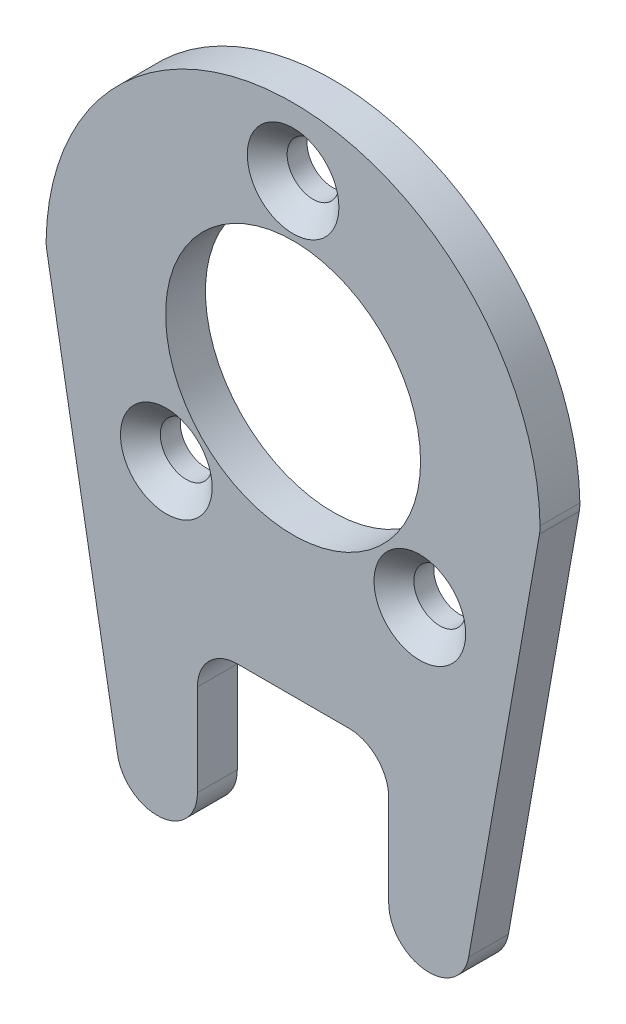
from build123d import *

# Parameters (mm, degrees)
ESQUISSE1_R      = 16
ESQUISSE1_R_2    = 3.25
EXTRUSION1_DEPTH = 5
CHANFREIN1_SIZE  = 2.5


with BuildPart() as part:
    # Esquisse1 → Extrusion1 (new body)
    with BuildSketch(Plane.XY):
        with BuildLine():
            Line((-22.304545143, -50.418353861), (-31.194661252, 0))
            ThreePointArc((-31.194661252, 0), (-31.254940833, 0.472550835), (-31.269975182, 0.948693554))
            ThreePointArc((-31.269975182, 0.948693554), (-0.273988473, 31.449887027), (30.721998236, 0.948693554))
            ThreePointArc((30.721998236, 0.948693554), (30.706963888, 0.472550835), (30.646684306, 0))
            Line((30.646684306, 0), (21.756568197, -50.418353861))
            ThreePointArc((21.756568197, -50.418353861), (20.046467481, -53.380335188), (16.832529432, -54.550112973))
            Line((16.832529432, -54.550112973), (16.726011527, -54.550112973))
            ThreePointArc((16.726011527, -54.550112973), (13.190477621, -53.085646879), (11.726011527, -49.550112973))
            Line((11.726011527, -49.550112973), (11.726011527, -38.050112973))
            ThreePointArc((11.726011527, -38.050112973), (10.261545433, -34.514579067), (6.726011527, -33.050112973))
            Line((6.726011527, -33.050112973), (-7.273988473, -33.050112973))
            ThreePointArc((-7.273988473, -33.050112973), (-10.809522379, -34.514579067), (-12.273988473, -38.050112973))
            Line((-12.273988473, -38.050112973), (-12.273988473, -49.550112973))
            ThreePointArc((-12.273988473, -49.550112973), (-13.738454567, -53.085646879), (-17.273988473, -54.550112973))
            Line((-17.273988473, -54.550112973), (-17.380506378, -54.550112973))
            ThreePointArc((-17.380506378, -54.550112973), (-20.594444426, -53.380335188), (-22.304545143, -50.418353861))
        make_face()
        with Locations((-0.273988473, 0.449887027)):
            Circle(ESQUISSE1_R, mode=Mode.SUBTRACT)
        with Locations((-0.273988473, 22.949887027)):
            Circle(ESQUISSE1_R_2, mode=Mode.SUBTRACT)
        with Locations((-16.183891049, -15.46001555)):
            Circle(ESQUISSE1_R_2, mode=Mode.SUBTRACT)
        with Locations((15.635914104, -15.46001555)):
            Circle(ESQUISSE1_R_2, mode=Mode.SUBTRACT)
    extrude(amount=EXTRUSION1_DEPTH)

    # Chanfrein1
    chanfrein1_edges = [part.edges().sort_by_distance(p)[0] for p in [
        (-3.523988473, 22.949887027, 5),
        (-19.433891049, -15.46001555, 5),
        (12.385914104, -15.46001555, 5),
    ]]
    chamfer(chanfrein1_edges, length=CHANFREIN1_SIZE)


solid = part.part
